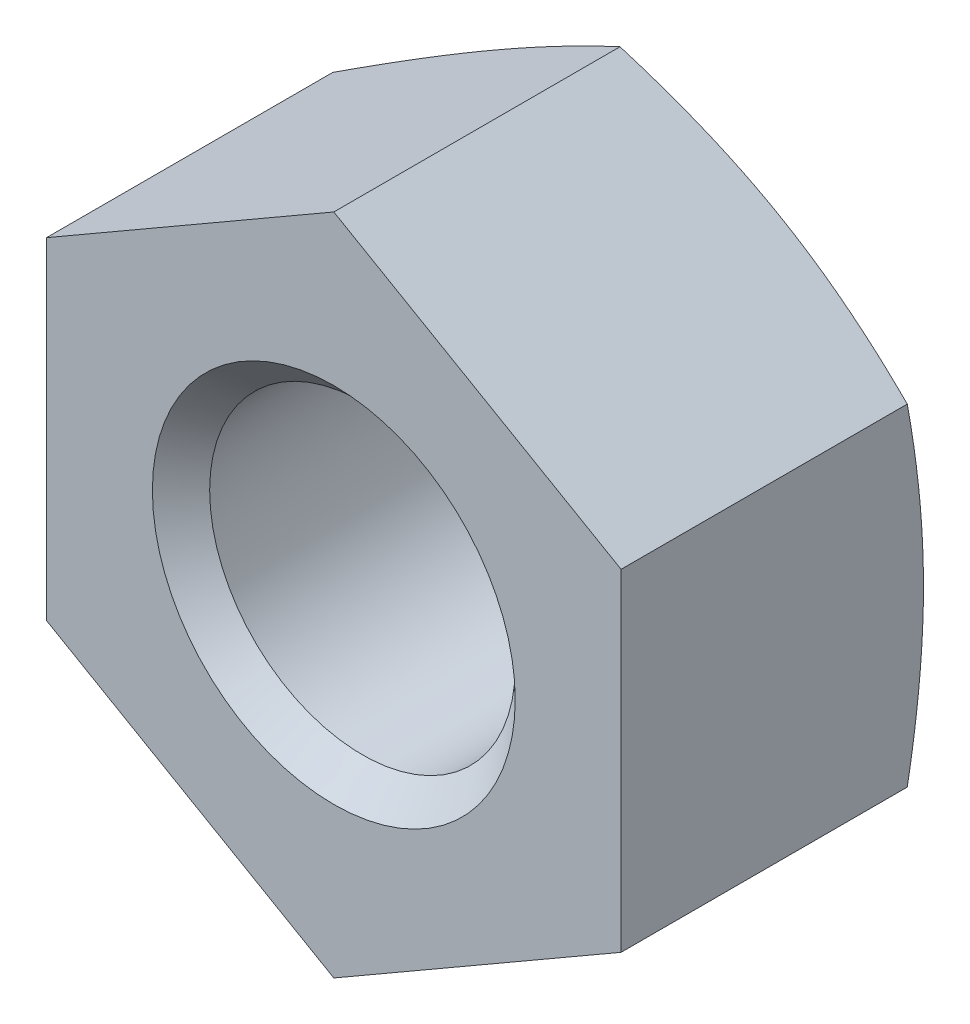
ISO-10303-21;
HEADER;
FILE_DESCRIPTION(('STEP AP214'),'2;1');
FILE_NAME('part.step','',(''),(''),'','','');
FILE_SCHEMA(('AUTOMOTIVE_DESIGN { 1 0 10303 214 1 1 1 1 }'));
ENDSEC;
DATA;
#1=APPLICATION_CONTEXT('core data for automotive mechanical design processes');
#2=APPLICATION_PROTOCOL_DEFINITION('international standard','automotive_design',2000,#1);
#3=PRODUCT_CONTEXT('',#1,'mechanical');
#4=PRODUCT('Part','Part','',(#3));
#5=PRODUCT_RELATED_PRODUCT_CATEGORY('part','',(#4));
#6=PRODUCT_DEFINITION_FORMATION('','',#4);
#7=PRODUCT_DEFINITION_CONTEXT('part definition',#1,'design');
#8=PRODUCT_DEFINITION('design','',#6,#7);
#9=PRODUCT_DEFINITION_SHAPE('','',#8);
#10=(LENGTH_UNIT() NAMED_UNIT(*) SI_UNIT(.MILLI.,.METRE.));
#11=(NAMED_UNIT(*) PLANE_ANGLE_UNIT() SI_UNIT($,.RADIAN.));
#12=(NAMED_UNIT(*) SI_UNIT($,.STERADIAN.) SOLID_ANGLE_UNIT());
#13=UNCERTAINTY_MEASURE_WITH_UNIT(LENGTH_MEASURE(1.E-05),#10,'distance_accuracy_value','');
#14=(GEOMETRIC_REPRESENTATION_CONTEXT(3) GLOBAL_UNCERTAINTY_ASSIGNED_CONTEXT((#13)) GLOBAL_UNIT_ASSIGNED_CONTEXT((#10,
#11,#12)) REPRESENTATION_CONTEXT('',''));
#15=CARTESIAN_POINT('',(0.,0.,0.));
#16=DIRECTION('',(0.,0.,1.));
#17=DIRECTION('',(1.,0.,0.));
#18=AXIS2_PLACEMENT_3D('',#15,#16,#17);
#19=CARTESIAN_POINT('',(0.,0.,0.538120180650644));
#20=DIRECTION('',(0.,0.,1.));
#21=DIRECTION('',(1.,0.,0.));
#22=AXIS2_PLACEMENT_3D('',#19,#20,#21);
#23=CONICAL_SURFACE('',#22,10.9784730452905,1.22173047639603);
#24=CARTESIAN_POINT('',(4.75,8.22724133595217,0.));
#25=CARTESIAN_POINT('',(4.94939489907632,8.11212063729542,-1.92574325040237E-05));
#26=CARTESIAN_POINT('',(5.14878664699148,7.99700175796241,0.00304607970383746));
#27=CARTESIAN_POINT('',(5.54742007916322,7.76685063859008,0.0152038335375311));
#28=CARTESIAN_POINT('',(5.74666177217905,7.65181839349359,0.0242958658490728));
#29=CARTESIAN_POINT('',(6.14446710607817,7.42214537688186,0.0483401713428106));
#30=CARTESIAN_POINT('',(6.34303129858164,7.30750428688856,0.063280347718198));
#31=CARTESIAN_POINT('',(6.73978297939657,7.07843959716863,0.0987555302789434));
#32=CARTESIAN_POINT('',(6.93797046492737,6.9640159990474,0.119290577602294));
#33=CARTESIAN_POINT('',(7.53163616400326,6.62126294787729,0.188791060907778));
#34=CARTESIAN_POINT('',(7.9264224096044,6.39333300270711,0.245664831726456));
#35=CARTESIAN_POINT('',(8.71458101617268,5.9382894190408,0.377495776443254));
#36=CARTESIAN_POINT('',(9.10794872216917,5.71117846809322,0.452490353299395));
#37=CARTESIAN_POINT('',(9.5,5.48482755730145,0.534910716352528));
#38=B_SPLINE_CURVE_WITH_KNOTS('',3,(#24,#25,#26,#27,#28,#29,#30,#31,#32,#33,#34,#35,#36,#37),
.UNSPECIFIED.,.F.,.F.,(4,2,2,2,2,2,4),(0.,0.690697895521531,1.38135174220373,2.07058446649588,
2.75982225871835,4.13758812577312,5.51822248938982),.UNSPECIFIED.);
#39=CARTESIAN_POINT('',(4.75,8.22724133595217,0.));
#40=VERTEX_POINT('',#39);
#41=CARTESIAN_POINT('',(9.5,5.48482755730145,0.534910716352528));
#42=VERTEX_POINT('',#41);
#43=EDGE_CURVE('E245',#40,#42,#38,.T.);
#44=ORIENTED_EDGE('',*,*,#43,.T.);
#45=CARTESIAN_POINT('',(9.5,5.48482755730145,0.534910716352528));
#46=CARTESIAN_POINT('',(9.5,5.03212573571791,0.452490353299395));
#47=CARTESIAN_POINT('',(9.5,4.57790383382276,0.377495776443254));
#48=CARTESIAN_POINT('',(9.5,3.66781666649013,0.245664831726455));
#49=CARTESIAN_POINT('',(9.5,3.21195677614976,0.188791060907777));
#50=CARTESIAN_POINT('',(9.5,2.52645067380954,0.119290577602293));
#51=CARTESIAN_POINT('',(9.5,2.29760347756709,0.0987555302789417));
#52=CARTESIAN_POINT('',(9.5,1.83947409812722,0.0632803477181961));
#53=CARTESIAN_POINT('',(9.5,1.61019191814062,0.0483401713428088));
#54=CARTESIAN_POINT('',(9.5,1.15084588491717,0.0242958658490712));
#55=CARTESIAN_POINT('',(9.5,0.920781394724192,0.0152038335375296));
#56=CARTESIAN_POINT('',(9.5,0.46047915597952,0.0030460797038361));
#57=CARTESIAN_POINT('',(9.5,0.230241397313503,-1.92574325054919E-05));
#58=CARTESIAN_POINT('',(9.5,0.,0.));
#59=B_SPLINE_CURVE_WITH_KNOTS('',3,(#45,#46,#47,#48,#49,#50,#51,#52,#53,#54,#55,#56,#57,#58),
.UNSPECIFIED.,.F.,.F.,(4,2,2,2,2,2,4),(0.,1.3806343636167,2.75840023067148,3.44763802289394,
4.1368707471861,4.8275245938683,5.51822248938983),.UNSPECIFIED.);
#60=CARTESIAN_POINT('',(9.5,0.,0.));
#61=VERTEX_POINT('',#60);
#62=EDGE_CURVE('E306',#42,#61,#59,.T.);
#63=ORIENTED_EDGE('',*,*,#62,.T.);
#64=CARTESIAN_POINT('',(0.,0.,0.));
#65=DIRECTION('',(0.,0.,1.));
#66=DIRECTION('',(1.,0.,0.));
#67=AXIS2_PLACEMENT_3D('',#64,#65,#66);
#68=CIRCLE('',#67,9.5);
#69=EDGE_CURVE('E253',#61,#40,#68,.T.);
#70=ORIENTED_EDGE('',*,*,#69,.T.);
#71=EDGE_LOOP('',(#44,#63,#70));
#72=FACE_BOUND('',#71,.T.);
#73=ADVANCED_FACE('F16',(#72),#23,.T.);
#74=CARTESIAN_POINT('',(0.,0.,0.538120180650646));
#75=DIRECTION('',(0.,0.,1.));
#76=DIRECTION('',(1.,0.,0.));
#77=AXIS2_PLACEMENT_3D('',#74,#75,#76);
#78=CONICAL_SURFACE('',#77,10.9784730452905,1.22173047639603);
#79=CARTESIAN_POINT('',(0.,10.9696551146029,0.534910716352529));
#80=CARTESIAN_POINT('',(0.392051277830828,10.7433042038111,0.452490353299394));
#81=CARTESIAN_POINT('',(0.785418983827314,10.5161932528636,0.377495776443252));
#82=CARTESIAN_POINT('',(1.57357759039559,10.0611496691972,0.245664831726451));
#83=CARTESIAN_POINT('',(1.96836383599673,9.83321972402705,0.188791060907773));
#84=CARTESIAN_POINT('',(2.56202953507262,9.49046667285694,0.119290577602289));
#85=CARTESIAN_POINT('',(2.76021702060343,9.37604307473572,0.0987555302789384));
#86=CARTESIAN_POINT('',(3.15696870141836,9.14697838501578,0.0632803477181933));
#87=CARTESIAN_POINT('',(3.35553289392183,9.03233729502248,0.0483401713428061));
#88=CARTESIAN_POINT('',(3.75333822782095,8.80266427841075,0.0242958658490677));
#89=CARTESIAN_POINT('',(3.95257992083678,8.68763203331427,0.0152038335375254));
#90=CARTESIAN_POINT('',(4.35121335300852,8.45748091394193,0.00304607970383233));
#91=CARTESIAN_POINT('',(4.55060510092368,8.34236203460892,-1.92574325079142E-05));
#92=CARTESIAN_POINT('',(4.75,8.22724133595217,0.));
#93=B_SPLINE_CURVE_WITH_KNOTS('',3,(#79,#80,#81,#82,#83,#84,#85,#86,#87,#88,#89,#90,#91,#92),
.UNSPECIFIED.,.F.,.F.,(4,2,2,2,2,2,4),(0.,1.3806343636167,2.75840023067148,3.44763802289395,
4.1368707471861,4.8275245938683,5.51822248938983),.UNSPECIFIED.);
#94=CARTESIAN_POINT('',(0.,10.9696551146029,0.53491071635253));
#95=VERTEX_POINT('',#94);
#96=EDGE_CURVE('E148',#95,#40,#93,.T.);
#97=ORIENTED_EDGE('',*,*,#96,.T.);
#98=CARTESIAN_POINT('',(0.,0.,0.));
#99=DIRECTION('',(0.,0.,1.));
#100=DIRECTION('',(1.,0.,0.));
#101=AXIS2_PLACEMENT_3D('',#98,#99,#100);
#102=CIRCLE('',#101,9.5);
#103=CARTESIAN_POINT('',(-4.75,8.22724133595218,0.));
#104=VERTEX_POINT('',#103);
#105=EDGE_CURVE('E256',#40,#104,#102,.T.);
#106=ORIENTED_EDGE('',*,*,#105,.T.);
#107=CARTESIAN_POINT('',(-4.75,8.22724133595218,0.));
#108=CARTESIAN_POINT('',(-4.55060510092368,8.34236203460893,-1.92574325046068E-05));
#109=CARTESIAN_POINT('',(-4.35121335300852,8.45748091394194,0.00304607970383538));
#110=CARTESIAN_POINT('',(-3.95257992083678,8.68763203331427,0.0152038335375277));
#111=CARTESIAN_POINT('',(-3.75333822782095,8.80266427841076,0.0242958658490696));
#112=CARTESIAN_POINT('',(-3.35553289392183,9.03233729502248,0.0483401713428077));
#113=CARTESIAN_POINT('',(-3.15696870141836,9.14697838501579,0.063280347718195));
#114=CARTESIAN_POINT('',(-2.76021702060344,9.37604307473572,0.0987555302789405));
#115=CARTESIAN_POINT('',(-2.56202953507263,9.49046667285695,0.119290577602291));
#116=CARTESIAN_POINT('',(-1.96836383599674,9.83321972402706,0.188791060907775));
#117=CARTESIAN_POINT('',(-1.5735775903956,10.0611496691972,0.245664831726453));
#118=CARTESIAN_POINT('',(-0.785418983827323,10.5161932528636,0.377495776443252));
#119=CARTESIAN_POINT('',(-0.392051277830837,10.7433042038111,0.452490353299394));
#120=CARTESIAN_POINT('',(0.,10.9696551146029,0.53491071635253));
#121=B_SPLINE_CURVE_WITH_KNOTS('',3,(#107,#108,#109,#110,#111,#112,#113,#114,#115,#116,#117,
#118,#119,#120),.UNSPECIFIED.,.F.,.F.,(4,2,2,2,2,2,4),(0.,0.69069789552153,1.38135174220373,
2.07058446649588,2.75982225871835,4.13758812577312,5.51822248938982),.UNSPECIFIED.);
#122=EDGE_CURVE('E98',#104,#95,#121,.T.);
#123=ORIENTED_EDGE('',*,*,#122,.T.);
#124=EDGE_LOOP('',(#97,#106,#123));
#125=FACE_BOUND('',#124,.T.);
#126=ADVANCED_FACE('F140',(#125),#78,.T.);
#127=CARTESIAN_POINT('',(0.,0.,0.538120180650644));
#128=DIRECTION('',(0.,0.,1.));
#129=DIRECTION('',(1.,0.,0.));
#130=AXIS2_PLACEMENT_3D('',#127,#128,#129);
#131=CONICAL_SURFACE('',#130,10.9784730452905,1.22173047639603);
#132=CARTESIAN_POINT('',(-9.5,0.,0.));
#133=CARTESIAN_POINT('',(-9.5,0.230241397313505,-1.92574325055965E-05));
#134=CARTESIAN_POINT('',(-9.5,0.460479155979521,0.00304607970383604));
#135=CARTESIAN_POINT('',(-9.5,0.920781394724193,0.0152038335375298));
#136=CARTESIAN_POINT('',(-9.5,1.15084588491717,0.0242958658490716));
#137=CARTESIAN_POINT('',(-9.5,1.61019191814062,0.0483401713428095));
#138=CARTESIAN_POINT('',(-9.5,1.83947409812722,0.0632803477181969));
#139=CARTESIAN_POINT('',(-9.5,2.29760347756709,0.0987555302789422));
#140=CARTESIAN_POINT('',(-9.5,2.52645067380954,0.119290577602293));
#141=CARTESIAN_POINT('',(-9.5,3.21195677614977,0.188791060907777));
#142=CARTESIAN_POINT('',(-9.5,3.66781666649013,0.245664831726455));
#143=CARTESIAN_POINT('',(-9.5,4.57790383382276,0.377495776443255));
#144=CARTESIAN_POINT('',(-9.5,5.03212573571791,0.452490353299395));
#145=CARTESIAN_POINT('',(-9.5,5.48482755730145,0.534910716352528));
#146=B_SPLINE_CURVE_WITH_KNOTS('',3,(#132,#133,#134,#135,#136,#137,#138,#139,#140,#141,#142,
#143,#144,#145),.UNSPECIFIED.,.F.,.F.,(4,2,2,2,2,2,4),(0.,0.690697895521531,1.38135174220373,
2.07058446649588,2.75982225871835,4.13758812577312,5.51822248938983),.UNSPECIFIED.);
#147=CARTESIAN_POINT('',(-9.5,0.,0.));
#148=VERTEX_POINT('',#147);
#149=CARTESIAN_POINT('',(-9.5,5.48482755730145,0.534910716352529));
#150=VERTEX_POINT('',#149);
#151=EDGE_CURVE('E105',#148,#150,#146,.T.);
#152=ORIENTED_EDGE('',*,*,#151,.T.);
#153=CARTESIAN_POINT('',(-9.5,5.48482755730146,0.534910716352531));
#154=CARTESIAN_POINT('',(-9.10794872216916,5.71117846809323,0.452490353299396));
#155=CARTESIAN_POINT('',(-8.71458101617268,5.9382894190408,0.377495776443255));
#156=CARTESIAN_POINT('',(-7.9264224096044,6.39333300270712,0.245664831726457));
#157=CARTESIAN_POINT('',(-7.53163616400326,6.6212629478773,0.18879106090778));
#158=CARTESIAN_POINT('',(-6.93797046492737,6.96401599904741,0.119290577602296));
#159=CARTESIAN_POINT('',(-6.73978297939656,7.07843959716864,0.0987555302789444));
#160=CARTESIAN_POINT('',(-6.34303129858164,7.30750428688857,0.0632803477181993));
#161=CARTESIAN_POINT('',(-6.14446710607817,7.42214537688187,0.0483401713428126));
#162=CARTESIAN_POINT('',(-5.74666177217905,7.6518183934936,0.0242958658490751));
#163=CARTESIAN_POINT('',(-5.54742007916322,7.76685063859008,0.0152038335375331));
#164=CARTESIAN_POINT('',(-5.14878664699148,7.99700175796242,0.00304607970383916));
#165=CARTESIAN_POINT('',(-4.94939489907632,8.11212063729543,-1.92574325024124E-05));
#166=CARTESIAN_POINT('',(-4.75,8.22724133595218,0.));
#167=B_SPLINE_CURVE_WITH_KNOTS('',3,(#153,#154,#155,#156,#157,#158,#159,#160,#161,#162,#163,
#164,#165,#166),.UNSPECIFIED.,.F.,.F.,(4,2,2,2,2,2,4),(0.,1.3806343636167,2.75840023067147,
3.44763802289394,4.13687074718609,4.82752459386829,5.51822248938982),.UNSPECIFIED.);
#168=EDGE_CURVE('E20',#150,#104,#167,.T.);
#169=ORIENTED_EDGE('',*,*,#168,.T.);
#170=CARTESIAN_POINT('',(0.,0.,0.));
#171=DIRECTION('',(0.,0.,1.));
#172=DIRECTION('',(1.,0.,0.));
#173=AXIS2_PLACEMENT_3D('',#170,#171,#172);
#174=CIRCLE('',#173,9.5);
#175=EDGE_CURVE('E112',#104,#148,#174,.T.);
#176=ORIENTED_EDGE('',*,*,#175,.T.);
#177=EDGE_LOOP('',(#152,#169,#176));
#178=FACE_BOUND('',#177,.T.);
#179=ADVANCED_FACE('F110',(#178),#131,.T.);
#180=CARTESIAN_POINT('',(0.,0.,0.538120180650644));
#181=DIRECTION('',(0.,0.,1.));
#182=DIRECTION('',(1.,0.,0.));
#183=AXIS2_PLACEMENT_3D('',#180,#181,#182);
#184=CONICAL_SURFACE('',#183,10.9784730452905,1.22173047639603);
#185=CARTESIAN_POINT('',(-4.75,-8.22724133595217,0.));
#186=CARTESIAN_POINT('',(-4.94939489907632,-8.11212063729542,-1.9257432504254E-05));
#187=CARTESIAN_POINT('',(-5.14878664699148,-7.99700175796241,0.00304607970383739));
#188=CARTESIAN_POINT('',(-5.54742007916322,-7.76685063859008,0.0152038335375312));
#189=CARTESIAN_POINT('',(-5.74666177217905,-7.65181839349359,0.0242958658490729));
#190=CARTESIAN_POINT('',(-6.14446710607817,-7.42214537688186,0.0483401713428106));
#191=CARTESIAN_POINT('',(-6.34303129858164,-7.30750428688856,0.063280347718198));
#192=CARTESIAN_POINT('',(-6.73978297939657,-7.07843959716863,0.0987555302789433));
#193=CARTESIAN_POINT('',(-6.93797046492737,-6.9640159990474,0.119290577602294));
#194=CARTESIAN_POINT('',(-7.53163616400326,-6.62126294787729,0.188791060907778));
#195=CARTESIAN_POINT('',(-7.9264224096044,-6.39333300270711,0.245664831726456));
#196=CARTESIAN_POINT('',(-8.71458101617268,-5.9382894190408,0.377495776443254));
#197=CARTESIAN_POINT('',(-9.10794872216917,-5.71117846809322,0.452490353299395));
#198=CARTESIAN_POINT('',(-9.5,-5.48482755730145,0.534910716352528));
#199=B_SPLINE_CURVE_WITH_KNOTS('',3,(#185,#186,#187,#188,#189,#190,#191,#192,#193,#194,#195,
#196,#197,#198),.UNSPECIFIED.,.F.,.F.,(4,2,2,2,2,2,4),(0.,0.690697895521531,1.38135174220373,
2.07058446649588,2.75982225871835,4.13758812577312,5.51822248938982),.UNSPECIFIED.);
#200=CARTESIAN_POINT('',(-4.75,-8.22724133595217,0.));
#201=VERTEX_POINT('',#200);
#202=CARTESIAN_POINT('',(-9.5,-5.48482755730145,0.534910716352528));
#203=VERTEX_POINT('',#202);
#204=EDGE_CURVE('E193',#201,#203,#199,.T.);
#205=ORIENTED_EDGE('',*,*,#204,.T.);
#206=CARTESIAN_POINT('',(-9.5,-5.48482755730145,0.534910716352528));
#207=CARTESIAN_POINT('',(-9.5,-5.03212573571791,0.452490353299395));
#208=CARTESIAN_POINT('',(-9.5,-4.57790383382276,0.377495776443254));
#209=CARTESIAN_POINT('',(-9.5,-3.66781666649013,0.245664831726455));
#210=CARTESIAN_POINT('',(-9.5,-3.21195677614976,0.188791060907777));
#211=CARTESIAN_POINT('',(-9.5,-2.52645067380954,0.119290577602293));
#212=CARTESIAN_POINT('',(-9.5,-2.29760347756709,0.0987555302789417));
#213=CARTESIAN_POINT('',(-9.5,-1.83947409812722,0.0632803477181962));
#214=CARTESIAN_POINT('',(-9.5,-1.61019191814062,0.0483401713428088));
#215=CARTESIAN_POINT('',(-9.5,-1.15084588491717,0.0242958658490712));
#216=CARTESIAN_POINT('',(-9.5,-0.920781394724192,0.0152038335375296));
#217=CARTESIAN_POINT('',(-9.5,-0.460479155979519,0.00304607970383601));
#218=CARTESIAN_POINT('',(-9.5,-0.230241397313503,-1.92574325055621E-05));
#219=CARTESIAN_POINT('',(-9.5,0.,0.));
#220=B_SPLINE_CURVE_WITH_KNOTS('',3,(#206,#207,#208,#209,#210,#211,#212,#213,#214,#215,#216,
#217,#218,#219),.UNSPECIFIED.,.F.,.F.,(4,2,2,2,2,2,4),(0.,1.3806343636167,2.75840023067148,
3.44763802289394,4.1368707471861,4.8275245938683,5.51822248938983),.UNSPECIFIED.);
#221=EDGE_CURVE('E114',#203,#148,#220,.T.);
#222=ORIENTED_EDGE('',*,*,#221,.T.);
#223=CARTESIAN_POINT('',(0.,0.,0.));
#224=DIRECTION('',(0.,0.,1.));
#225=DIRECTION('',(1.,0.,0.));
#226=AXIS2_PLACEMENT_3D('',#223,#224,#225);
#227=CIRCLE('',#226,9.5);
#228=EDGE_CURVE('E259',#148,#201,#227,.T.);
#229=ORIENTED_EDGE('',*,*,#228,.T.);
#230=EDGE_LOOP('',(#205,#222,#229));
#231=FACE_BOUND('',#230,.T.);
#232=ADVANCED_FACE('F139',(#231),#184,.T.);
#233=CARTESIAN_POINT('',(0.,0.,0.538120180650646));
#234=DIRECTION('',(0.,0.,1.));
#235=DIRECTION('',(1.,0.,0.));
#236=AXIS2_PLACEMENT_3D('',#233,#234,#235);
#237=CONICAL_SURFACE('',#236,10.9784730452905,1.22173047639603);
#238=CARTESIAN_POINT('',(4.75,-8.22724133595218,0.));
#239=CARTESIAN_POINT('',(4.55060510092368,-8.34236203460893,-1.92574325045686E-05));
#240=CARTESIAN_POINT('',(4.35121335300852,-8.45748091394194,0.00304607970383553));
#241=CARTESIAN_POINT('',(3.95257992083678,-8.68763203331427,0.0152038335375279));
#242=CARTESIAN_POINT('',(3.75333822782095,-8.80266427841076,0.0242958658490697));
#243=CARTESIAN_POINT('',(3.35553289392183,-9.03233729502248,0.0483401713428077));
#244=CARTESIAN_POINT('',(3.15696870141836,-9.14697838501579,0.063280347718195));
#245=CARTESIAN_POINT('',(2.76021702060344,-9.37604307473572,0.0987555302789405));
#246=CARTESIAN_POINT('',(2.56202953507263,-9.49046667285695,0.119290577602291));
#247=CARTESIAN_POINT('',(1.96836383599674,-9.83321972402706,0.188791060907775));
#248=CARTESIAN_POINT('',(1.5735775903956,-10.0611496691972,0.245664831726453));
#249=CARTESIAN_POINT('',(0.785418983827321,-10.5161932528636,0.377495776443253));
#250=CARTESIAN_POINT('',(0.392051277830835,-10.7433042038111,0.452490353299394));
#251=CARTESIAN_POINT('',(0.,-10.9696551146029,0.534910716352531));
#252=B_SPLINE_CURVE_WITH_KNOTS('',3,(#238,#239,#240,#241,#242,#243,#244,#245,#246,#247,#248,
#249,#250,#251),.UNSPECIFIED.,.F.,.F.,(4,2,2,2,2,2,4),(0.,0.69069789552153,1.38135174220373,
2.07058446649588,2.75982225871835,4.13758812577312,5.51822248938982),.UNSPECIFIED.);
#253=CARTESIAN_POINT('',(4.75,-8.22724133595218,0.));
#254=VERTEX_POINT('',#253);
#255=CARTESIAN_POINT('',(0.,-10.9696551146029,0.53491071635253));
#256=VERTEX_POINT('',#255);
#257=EDGE_CURVE('E187',#254,#256,#252,.T.);
#258=ORIENTED_EDGE('',*,*,#257,.T.);
#259=CARTESIAN_POINT('',(0.,-10.9696551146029,0.534910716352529));
#260=CARTESIAN_POINT('',(-0.392051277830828,-10.7433042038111,0.452490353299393));
#261=CARTESIAN_POINT('',(-0.785418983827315,-10.5161932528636,0.377495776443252));
#262=CARTESIAN_POINT('',(-1.57357759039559,-10.0611496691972,0.245664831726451));
#263=CARTESIAN_POINT('',(-1.96836383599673,-9.83321972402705,0.188791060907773));
#264=CARTESIAN_POINT('',(-2.56202953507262,-9.49046667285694,0.119290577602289));
#265=CARTESIAN_POINT('',(-2.76021702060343,-9.37604307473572,0.0987555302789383));
#266=CARTESIAN_POINT('',(-3.15696870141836,-9.14697838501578,0.0632803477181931));
#267=CARTESIAN_POINT('',(-3.35553289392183,-9.03233729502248,0.048340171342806));
#268=CARTESIAN_POINT('',(-3.75333822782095,-8.80266427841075,0.0242958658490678));
#269=CARTESIAN_POINT('',(-3.95257992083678,-8.68763203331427,0.0152038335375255));
#270=CARTESIAN_POINT('',(-4.35121335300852,-8.45748091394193,0.00304607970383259));
#271=CARTESIAN_POINT('',(-4.55060510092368,-8.34236203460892,-1.92574325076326E-05));
#272=CARTESIAN_POINT('',(-4.75,-8.22724133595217,0.));
#273=B_SPLINE_CURVE_WITH_KNOTS('',3,(#259,#260,#261,#262,#263,#264,#265,#266,#267,#268,#269,
#270,#271,#272),.UNSPECIFIED.,.F.,.F.,(4,2,2,2,2,2,4),(0.,1.3806343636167,2.75840023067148,
3.44763802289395,4.1368707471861,4.8275245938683,5.51822248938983),.UNSPECIFIED.);
#274=EDGE_CURVE('E108',#256,#201,#273,.T.);
#275=ORIENTED_EDGE('',*,*,#274,.T.);
#276=CARTESIAN_POINT('',(0.,0.,0.));
#277=DIRECTION('',(0.,0.,1.));
#278=DIRECTION('',(1.,0.,0.));
#279=AXIS2_PLACEMENT_3D('',#276,#277,#278);
#280=CIRCLE('',#279,9.5);
#281=EDGE_CURVE('E262',#201,#254,#280,.T.);
#282=ORIENTED_EDGE('',*,*,#281,.T.);
#283=EDGE_LOOP('',(#258,#275,#282));
#284=FACE_BOUND('',#283,.T.);
#285=ADVANCED_FACE('F167',(#284),#237,.T.);
#286=CARTESIAN_POINT('',(0.,0.,0.538120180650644));
#287=DIRECTION('',(0.,0.,1.));
#288=DIRECTION('',(1.,0.,0.));
#289=AXIS2_PLACEMENT_3D('',#286,#287,#288);
#290=CONICAL_SURFACE('',#289,10.9784730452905,1.22173047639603);
#291=CARTESIAN_POINT('',(9.5,0.,0.));
#292=CARTESIAN_POINT('',(9.5,-0.230241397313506,-1.92574325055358E-05));
#293=CARTESIAN_POINT('',(9.5,-0.460479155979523,0.00304607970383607));
#294=CARTESIAN_POINT('',(9.5,-0.920781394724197,0.0152038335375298));
#295=CARTESIAN_POINT('',(9.5,-1.15084588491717,0.0242958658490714));
#296=CARTESIAN_POINT('',(9.5,-1.61019191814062,0.0483401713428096));
#297=CARTESIAN_POINT('',(9.5,-1.83947409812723,0.0632803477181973));
#298=CARTESIAN_POINT('',(9.5,-2.2976034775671,0.098755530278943));
#299=CARTESIAN_POINT('',(9.5,-2.52645067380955,0.119290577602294));
#300=CARTESIAN_POINT('',(9.5,-3.21195677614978,0.188791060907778));
#301=CARTESIAN_POINT('',(9.5,-3.66781666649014,0.245664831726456));
#302=CARTESIAN_POINT('',(9.5,-4.57790383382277,0.377495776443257));
#303=CARTESIAN_POINT('',(9.5,-5.03212573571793,0.452490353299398));
#304=CARTESIAN_POINT('',(9.5,-5.48482755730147,0.534910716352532));
#305=B_SPLINE_CURVE_WITH_KNOTS('',3,(#291,#292,#293,#294,#295,#296,#297,#298,#299,#300,#301,
#302,#303,#304),.UNSPECIFIED.,.F.,.F.,(4,2,2,2,2,2,4),(0.,0.690697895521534,1.38135174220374,
2.07058446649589,2.75982225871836,4.13758812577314,5.51822248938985),.UNSPECIFIED.);
#306=CARTESIAN_POINT('',(9.5,-5.48482755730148,0.53491071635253));
#307=VERTEX_POINT('',#306);
#308=EDGE_CURVE('E171',#61,#307,#305,.T.);
#309=ORIENTED_EDGE('',*,*,#308,.T.);
#310=CARTESIAN_POINT('',(9.5,-5.48482755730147,0.534910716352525));
#311=CARTESIAN_POINT('',(9.10794872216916,-5.71117846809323,0.452490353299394));
#312=CARTESIAN_POINT('',(8.71458101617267,-5.93828941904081,0.377495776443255));
#313=CARTESIAN_POINT('',(7.9264224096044,-6.39333300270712,0.245664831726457));
#314=CARTESIAN_POINT('',(7.53163616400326,-6.6212629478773,0.188791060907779));
#315=CARTESIAN_POINT('',(6.93797046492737,-6.96401599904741,0.119290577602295));
#316=CARTESIAN_POINT('',(6.73978297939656,-7.07843959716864,0.0987555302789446));
#317=CARTESIAN_POINT('',(6.34303129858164,-7.30750428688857,0.0632803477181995));
#318=CARTESIAN_POINT('',(6.14446710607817,-7.42214537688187,0.0483401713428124));
#319=CARTESIAN_POINT('',(5.74666177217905,-7.6518183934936,0.0242958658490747));
#320=CARTESIAN_POINT('',(5.54742007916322,-7.76685063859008,0.0152038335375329));
#321=CARTESIAN_POINT('',(5.14878664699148,-7.99700175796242,0.00304607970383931));
#322=CARTESIAN_POINT('',(4.94939489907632,-8.11212063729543,-1.92574325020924E-05));
#323=CARTESIAN_POINT('',(4.75,-8.22724133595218,0.));
#324=B_SPLINE_CURVE_WITH_KNOTS('',3,(#310,#311,#312,#313,#314,#315,#316,#317,#318,#319,#320,
#321,#322,#323),.UNSPECIFIED.,.F.,.F.,(4,2,2,2,2,2,4),(0.,1.3806343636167,2.75840023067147,
3.44763802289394,4.13687074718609,4.82752459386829,5.51822248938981),.UNSPECIFIED.);
#325=EDGE_CURVE('E179',#307,#254,#324,.T.);
#326=ORIENTED_EDGE('',*,*,#325,.T.);
#327=CARTESIAN_POINT('',(0.,0.,0.));
#328=DIRECTION('',(0.,0.,1.));
#329=DIRECTION('',(1.,0.,0.));
#330=AXIS2_PLACEMENT_3D('',#327,#328,#329);
#331=CIRCLE('',#330,9.5);
#332=EDGE_CURVE('E265',#254,#61,#331,.T.);
#333=ORIENTED_EDGE('',*,*,#332,.T.);
#334=EDGE_LOOP('',(#309,#326,#333));
#335=FACE_BOUND('',#334,.T.);
#336=ADVANCED_FACE('F163',(#335),#290,.T.);
#337=CARTESIAN_POINT('',(0.,10.9696551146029,10.));
#338=DIRECTION('',(0.5,-0.866025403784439,0.));
#339=DIRECTION('',(0.866025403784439,0.5,0.));
#340=AXIS2_PLACEMENT_3D('',#337,#338,#339);
#341=PLANE('',#340);
#342=ORIENTED_EDGE('',*,*,#122,.F.);
#343=ORIENTED_EDGE('',*,*,#168,.F.);
#344=DIRECTION('',(0.,0.,-1.));
#345=VECTOR('',#344,1.);
#346=CARTESIAN_POINT('',(-9.5,5.48482755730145,10.));
#347=LINE('',#346,#345);
#348=CARTESIAN_POINT('',(-9.5,5.48482755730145,10.));
#349=VERTEX_POINT('',#348);
#350=EDGE_CURVE('E95',#150,#349,#347,.F.);
#351=ORIENTED_EDGE('',*,*,#350,.T.);
#352=DIRECTION('',(-0.866025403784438,-0.5,0.));
#353=VECTOR('',#352,1.);
#354=CARTESIAN_POINT('',(0.,10.9696551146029,10.));
#355=LINE('',#354,#353);
#356=CARTESIAN_POINT('',(0.,10.9696551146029,10.));
#357=VERTEX_POINT('',#356);
#358=EDGE_CURVE('E268',#357,#349,#355,.T.);
#359=ORIENTED_EDGE('',*,*,#358,.F.);
#360=DIRECTION('',(0.,0.,1.));
#361=VECTOR('',#360,1.);
#362=CARTESIAN_POINT('',(0.,10.9696551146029,10.));
#363=LINE('',#362,#361);
#364=EDGE_CURVE('E312',#357,#95,#363,.F.);
#365=ORIENTED_EDGE('',*,*,#364,.T.);
#366=EDGE_LOOP('',(#342,#343,#351,#359,#365));
#367=FACE_BOUND('',#366,.T.);
#368=ADVANCED_FACE('F93',(#367),#341,.F.);
#369=CARTESIAN_POINT('',(-9.5,5.48482755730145,10.));
#370=DIRECTION('',(1.,0.,0.));
#371=DIRECTION('',(0.,0.,-1.));
#372=AXIS2_PLACEMENT_3D('',#369,#370,#371);
#373=PLANE('',#372);
#374=ORIENTED_EDGE('',*,*,#151,.F.);
#375=ORIENTED_EDGE('',*,*,#221,.F.);
#376=DIRECTION('',(0.,0.,1.));
#377=VECTOR('',#376,1.);
#378=CARTESIAN_POINT('',(-9.5,-5.48482755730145,10.));
#379=LINE('',#378,#377);
#380=CARTESIAN_POINT('',(-9.5,-5.48482755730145,10.));
#381=VERTEX_POINT('',#380);
#382=EDGE_CURVE('E188',#203,#381,#379,.T.);
#383=ORIENTED_EDGE('',*,*,#382,.T.);
#384=DIRECTION('',(0.,1.,0.));
#385=VECTOR('',#384,1.);
#386=CARTESIAN_POINT('',(-9.5,0.,10.));
#387=LINE('',#386,#385);
#388=EDGE_CURVE('E107',#349,#381,#387,.F.);
#389=ORIENTED_EDGE('',*,*,#388,.F.);
#390=ORIENTED_EDGE('',*,*,#350,.F.);
#391=EDGE_LOOP('',(#374,#375,#383,#389,#390));
#392=FACE_BOUND('',#391,.T.);
#393=ADVANCED_FACE('F104',(#392),#373,.F.);
#394=CARTESIAN_POINT('',(-9.5,-5.48482755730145,10.));
#395=DIRECTION('',(0.5,0.866025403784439,0.));
#396=DIRECTION('',(-0.866025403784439,0.5,0.));
#397=AXIS2_PLACEMENT_3D('',#394,#395,#396);
#398=PLANE('',#397);
#399=ORIENTED_EDGE('',*,*,#204,.F.);
#400=ORIENTED_EDGE('',*,*,#274,.F.);
#401=DIRECTION('',(0.,0.,1.));
#402=VECTOR('',#401,1.);
#403=CARTESIAN_POINT('',(0.,-10.9696551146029,10.));
#404=LINE('',#403,#402);
#405=CARTESIAN_POINT('',(0.,-10.9696551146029,10.));
#406=VERTEX_POINT('',#405);
#407=EDGE_CURVE('E303',#256,#406,#404,.T.);
#408=ORIENTED_EDGE('',*,*,#407,.T.);
#409=DIRECTION('',(0.866025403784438,-0.5,0.));
#410=VECTOR('',#409,1.);
#411=CARTESIAN_POINT('',(-9.5,-5.48482755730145,10.));
#412=LINE('',#411,#410);
#413=EDGE_CURVE('E279',#381,#406,#412,.T.);
#414=ORIENTED_EDGE('',*,*,#413,.F.);
#415=ORIENTED_EDGE('',*,*,#382,.F.);
#416=EDGE_LOOP('',(#399,#400,#408,#414,#415));
#417=FACE_BOUND('',#416,.T.);
#418=ADVANCED_FACE('F202',(#417),#398,.F.);
#419=CARTESIAN_POINT('',(0.,-10.9696551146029,10.));
#420=DIRECTION('',(-0.5,0.866025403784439,0.));
#421=DIRECTION('',(-0.866025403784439,-0.5,0.));
#422=AXIS2_PLACEMENT_3D('',#419,#420,#421);
#423=PLANE('',#422);
#424=ORIENTED_EDGE('',*,*,#257,.F.);
#425=ORIENTED_EDGE('',*,*,#325,.F.);
#426=DIRECTION('',(0.,0.,1.));
#427=VECTOR('',#426,1.);
#428=CARTESIAN_POINT('',(9.5,-5.48482755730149,10.));
#429=LINE('',#428,#427);
#430=CARTESIAN_POINT('',(9.5,-5.48482755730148,10.));
#431=VERTEX_POINT('',#430);
#432=EDGE_CURVE('E309',#307,#431,#429,.T.);
#433=ORIENTED_EDGE('',*,*,#432,.T.);
#434=DIRECTION('',(0.866025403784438,0.5,0.));
#435=VECTOR('',#434,1.);
#436=CARTESIAN_POINT('',(0.,-10.9696551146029,10.));
#437=LINE('',#436,#435);
#438=EDGE_CURVE('E283',#406,#431,#437,.T.);
#439=ORIENTED_EDGE('',*,*,#438,.F.);
#440=ORIENTED_EDGE('',*,*,#407,.F.);
#441=EDGE_LOOP('',(#424,#425,#433,#439,#440));
#442=FACE_BOUND('',#441,.T.);
#443=ADVANCED_FACE('F198',(#442),#423,.F.);
#444=CARTESIAN_POINT('',(9.5,-5.48482755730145,10.));
#445=DIRECTION('',(-1.,0.,0.));
#446=DIRECTION('',(0.,0.,1.));
#447=AXIS2_PLACEMENT_3D('',#444,#445,#446);
#448=PLANE('',#447);
#449=ORIENTED_EDGE('',*,*,#308,.F.);
#450=ORIENTED_EDGE('',*,*,#62,.F.);
#451=DIRECTION('',(0.,0.,1.));
#452=VECTOR('',#451,1.);
#453=CARTESIAN_POINT('',(9.5,5.48482755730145,10.));
#454=LINE('',#453,#452);
#455=CARTESIAN_POINT('',(9.5,5.48482755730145,10.));
#456=VERTEX_POINT('',#455);
#457=EDGE_CURVE('E252',#42,#456,#454,.T.);
#458=ORIENTED_EDGE('',*,*,#457,.T.);
#459=DIRECTION('',(0.,1.,0.));
#460=VECTOR('',#459,1.);
#461=CARTESIAN_POINT('',(9.5,0.,10.));
#462=LINE('',#461,#460);
#463=EDGE_CURVE('E41',#431,#456,#462,.T.);
#464=ORIENTED_EDGE('',*,*,#463,.F.);
#465=ORIENTED_EDGE('',*,*,#432,.F.);
#466=EDGE_LOOP('',(#449,#450,#458,#464,#465));
#467=FACE_BOUND('',#466,.T.);
#468=ADVANCED_FACE('F201',(#467),#448,.F.);
#469=CARTESIAN_POINT('',(9.5,5.48482755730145,10.));
#470=DIRECTION('',(-0.5,-0.866025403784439,0.));
#471=DIRECTION('',(0.866025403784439,-0.5,0.));
#472=AXIS2_PLACEMENT_3D('',#469,#470,#471);
#473=PLANE('',#472);
#474=ORIENTED_EDGE('',*,*,#43,.F.);
#475=ORIENTED_EDGE('',*,*,#96,.F.);
#476=ORIENTED_EDGE('',*,*,#364,.F.);
#477=DIRECTION('',(-0.866025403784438,0.5,0.));
#478=VECTOR('',#477,1.);
#479=CARTESIAN_POINT('',(9.5,5.48482755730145,10.));
#480=LINE('',#479,#478);
#481=EDGE_CURVE('E273',#456,#357,#480,.T.);
#482=ORIENTED_EDGE('',*,*,#481,.F.);
#483=ORIENTED_EDGE('',*,*,#457,.F.);
#484=EDGE_LOOP('',(#474,#475,#476,#482,#483));
#485=FACE_BOUND('',#484,.T.);
#486=ADVANCED_FACE('F239',(#485),#473,.F.);
#487=CARTESIAN_POINT('',(0.,0.,0.));
#488=DIRECTION('',(0.,0.,1.));
#489=DIRECTION('',(1.,0.,0.));
#490=AXIS2_PLACEMENT_3D('',#487,#488,#489);
#491=PLANE('',#490);
#492=CARTESIAN_POINT('',(0.,0.,5.6843418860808E-11));
#493=DIRECTION('',(0.,0.,-1.));
#494=DIRECTION('',(-1.,0.,0.));
#495=AXIS2_PLACEMENT_3D('',#492,#493,#494);
#496=CIRCLE('',#495,5.99999999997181);
#497=CARTESIAN_POINT('',(-5.99999999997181,0.,5.6843418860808E-11));
#498=VERTEX_POINT('',#497);
#499=EDGE_CURVE('E269',#498,#498,#496,.F.);
#500=ORIENTED_EDGE('',*,*,#499,.T.);
#501=EDGE_LOOP('',(#500));
#502=FACE_BOUND('',#501,.T.);
#503=ORIENTED_EDGE('',*,*,#281,.F.);
#504=ORIENTED_EDGE('',*,*,#228,.F.);
#505=ORIENTED_EDGE('',*,*,#175,.F.);
#506=ORIENTED_EDGE('',*,*,#105,.F.);
#507=ORIENTED_EDGE('',*,*,#69,.F.);
#508=ORIENTED_EDGE('',*,*,#332,.F.);
#509=EDGE_LOOP('',(#503,#504,#505,#506,#507,#508));
#510=FACE_BOUND('',#509,.T.);
#511=ADVANCED_FACE('F236',(#502,#510),#491,.F.);
#512=CARTESIAN_POINT('',(0.,0.,10.));
#513=DIRECTION('',(0.,0.,1.));
#514=DIRECTION('',(1.,0.,0.));
#515=AXIS2_PLACEMENT_3D('',#512,#513,#514);
#516=PLANE('',#515);
#517=CARTESIAN_POINT('',(0.,0.,10.0000000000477));
#518=DIRECTION('',(0.,0.,1.));
#519=DIRECTION('',(1.,0.,0.));
#520=AXIS2_PLACEMENT_3D('',#517,#518,#519);
#521=CIRCLE('',#520,6.00000000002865);
#522=CARTESIAN_POINT('',(6.00000000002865,0.,10.0000000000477));
#523=VERTEX_POINT('',#522);
#524=EDGE_CURVE('E272',#523,#523,#521,.F.);
#525=ORIENTED_EDGE('',*,*,#524,.T.);
#526=EDGE_LOOP('',(#525));
#527=FACE_BOUND('',#526,.T.);
#528=ORIENTED_EDGE('',*,*,#463,.T.);
#529=ORIENTED_EDGE('',*,*,#481,.T.);
#530=ORIENTED_EDGE('',*,*,#358,.T.);
#531=ORIENTED_EDGE('',*,*,#388,.T.);
#532=ORIENTED_EDGE('',*,*,#413,.T.);
#533=ORIENTED_EDGE('',*,*,#438,.T.);
#534=EDGE_LOOP('',(#528,#529,#530,#531,#532,#533));
#535=FACE_BOUND('',#534,.T.);
#536=ADVANCED_FACE('F232',(#527,#535),#516,.T.);
#537=CARTESIAN_POINT('',(0.,0.,1.13686837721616E-10));
#538=DIRECTION('',(0.,0.,-1.));
#539=DIRECTION('',(-1.,0.,0.));
#540=AXIS2_PLACEMENT_3D('',#537,#538,#539);
#541=CONICAL_SURFACE('',#540,5.99999999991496,0.785398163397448);
#542=CARTESIAN_POINT('',(0.,0.,0.947));
#543=DIRECTION('',(0.,0.,1.));
#544=DIRECTION('',(1.,0.,0.));
#545=AXIS2_PLACEMENT_3D('',#542,#543,#544);
#546=CIRCLE('',#545,5.053);
#547=CARTESIAN_POINT('',(5.053,0.,0.947));
#548=VERTEX_POINT('',#547);
#549=EDGE_CURVE('E32',#548,#548,#546,.T.);
#550=ORIENTED_EDGE('',*,*,#549,.T.);
#551=EDGE_LOOP('',(#550));
#552=FACE_BOUND('',#551,.T.);
#553=ORIENTED_EDGE('',*,*,#499,.F.);
#554=EDGE_LOOP('',(#553));
#555=FACE_BOUND('',#554,.T.);
#556=ADVANCED_FACE('F224',(#552,#555),#541,.F.);
#557=CARTESIAN_POINT('',(0.,0.,9.99999999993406));
#558=DIRECTION('',(0.,0.,1.));
#559=DIRECTION('',(1.,0.,0.));
#560=AXIS2_PLACEMENT_3D('',#557,#558,#559);
#561=CONICAL_SURFACE('',#560,5.99999999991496,0.785398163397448);
#562=ORIENTED_EDGE('',*,*,#524,.F.);
#563=EDGE_LOOP('',(#562));
#564=FACE_BOUND('',#563,.T.);
#565=CARTESIAN_POINT('',(0.,0.,9.053));
#566=DIRECTION('',(0.,0.,1.));
#567=DIRECTION('',(1.,0.,0.));
#568=AXIS2_PLACEMENT_3D('',#565,#566,#567);
#569=CIRCLE('',#568,5.053);
#570=CARTESIAN_POINT('',(5.053,0.,9.053));
#571=VERTEX_POINT('',#570);
#572=EDGE_CURVE('E11',#571,#571,#569,.F.);
#573=ORIENTED_EDGE('',*,*,#572,.T.);
#574=EDGE_LOOP('',(#573));
#575=FACE_BOUND('',#574,.T.);
#576=ADVANCED_FACE('F217',(#564,#575),#561,.F.);
#577=CARTESIAN_POINT('',(0.,0.,0.));
#578=DIRECTION('',(0.,0.,1.));
#579=DIRECTION('',(1.,0.,0.));
#580=AXIS2_PLACEMENT_3D('',#577,#578,#579);
#581=CYLINDRICAL_SURFACE('',#580,5.053);
#582=ORIENTED_EDGE('',*,*,#572,.F.);
#583=EDGE_LOOP('',(#582));
#584=FACE_BOUND('',#583,.T.);
#585=ORIENTED_EDGE('',*,*,#549,.F.);
#586=EDGE_LOOP('',(#585));
#587=FACE_BOUND('',#586,.T.);
#588=ADVANCED_FACE('F215',(#584,#587),#581,.F.);
#589=CLOSED_SHELL('',(#73,#126,#179,#232,#285,#336,#368,#393,#418,#443,#468,#486,#511,#536,#556,
#576,#588));
#590=MANIFOLD_SOLID_BREP('B1',#589);
#591=ADVANCED_BREP_SHAPE_REPRESENTATION('',(#18,#590),#14);
#592=SHAPE_DEFINITION_REPRESENTATION(#9,#591);
ENDSEC;
END-ISO-10303-21;
